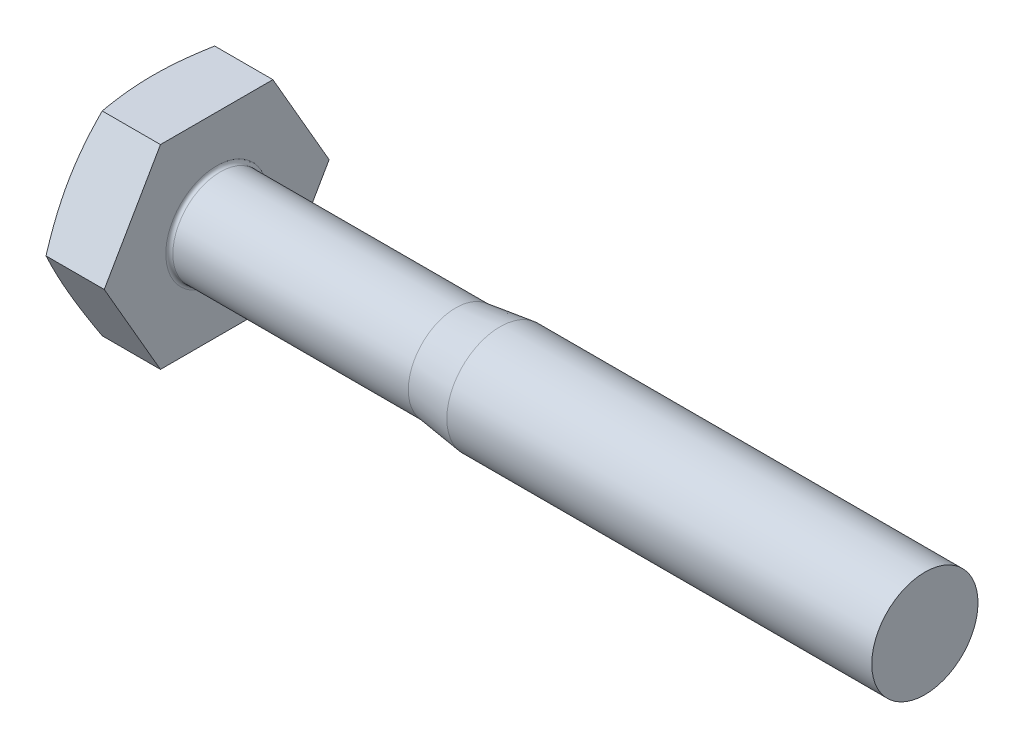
from build123d import *

# Parameters (mm, degrees)
BASEHEAD_DEPTH     = 2
SKETCH2_R          = 1.5
BASEBODY_DEPTH     = 20
SKETCH4_R          = 1.8
CUT_EXTRUDE1_DEPTH = 0.4
HEADFILLET_R       = 0.1


with BuildPart() as part:
    # Sketch1 → BaseHead (new body)
    with BuildSketch(Plane(origin=(0, 0, 0), x_dir=(0, 0, -1), z_dir=(1, 0, 0))):
        Polygon((3.175426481, 0), (1.58771324, 2.75), (-1.58771324, 2.75), (-3.175426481, 0), (-1.58771324, -2.75), (1.58771324, -2.75), align=None)
    extrude(amount=BASEHEAD_DEPTH)

    # Sketch2 → BaseBody (add)
    with BuildSketch(Plane(origin=(2, 0, 0), x_dir=(0, 0, -1), z_dir=(1, 0, 0))):
        Circle(SKETCH2_R)
    extrude(amount=BASEBODY_DEPTH)

    # Sketch3 → HeadChamfer (revolve, cut)
    with BuildSketch(Plane(origin=(3.161211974, 0, 2.612290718), x_dir=(0, 0, -1), z_dir=(0, 1, 0)), mode=Mode.PRIVATE) as headchamfer_sk:
        Polygon((5.787717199, 3.161211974), (5.787717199, 2.806185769), (4.812290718, 3.161211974), align=None)
    revolve(headchamfer_sk.sketch.rotate(Axis((-2.071354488, 0, 0), (1, 0, 0)), 180), axis=Axis((-2.071354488, 0, 0), (1, 0, 0)), mode=Mode.SUBTRACT)

    # Sketch4 → Cut-Extrude1 (cut)
    with BuildSketch(Plane.ZY):
        Circle(SKETCH4_R)
    extrude(amount=-CUT_EXTRUDE1_DEPTH, mode=Mode.SUBTRACT)

    # Sketch5 → Cut-Revolve1 (revolve, cut)
    with BuildSketch(Plane(origin=(-2.67963122, 0, 8.17963122), x_dir=(0, 0, -1), z_dir=(0, 1, 0)), mode=Mode.PRIVATE) as cut_revolve1_sk:
        Polygon((9.67963122, -12.67963122), (9.51713122, -11.42963122), (9.51713122, -4.67963122), (10.85463122, -4.67963122), (10.85463122, -12.67963122), align=None)
    revolve(cut_revolve1_sk.sketch.rotate(Axis((-2.697175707, 0, 0), (1, 0, 0)), 180), axis=Axis((-2.697175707, 0, 0), (1, 0, 0)), mode=Mode.SUBTRACT)

    # HeadFillet
    headfillet_edges = [part.edges().sort_by_distance(p)[0] for p in [
        (2, 0, -1.3375),
    ]]
    fillet(headfillet_edges, radius=HEADFILLET_R)


solid = part.part
